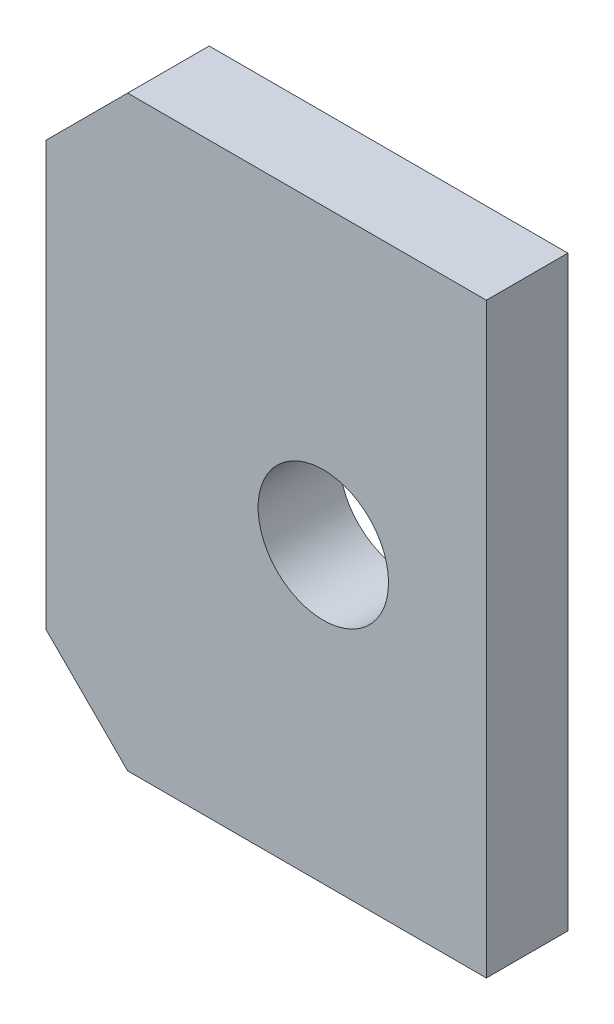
from build123d import *

# Parameters (mm, degrees)
SKICA1_W                           = 27
SKICA1_H                           = 36
VYSUNOUT1_DEPTH                    = 5
M9_0_9_000000_PR_M_ROV_D_RY1_D     = 8
M9_0_9_000000_PR_M_ROV_D_RY1_DEPTH = 15
M9_0_9_000000_PR_M_ROV_D_RY1_TIP   = 2.403442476
ZKOSIT1_SIZE                       = 5


with BuildPart() as part:
    # Skica1 → Vysunout1 (new body)
    with BuildSketch(Plane.XY):
        Rectangle(SKICA1_W, SKICA1_H)
    extrude(amount=VYSUNOUT1_DEPTH)

    # M9.0 _9.000000_ pr_m_rov_ d_ry1
    with Locations(Plane.XY.offset(5)):
        with Locations((3.5, 0)):
            Hole(M9_0_9_000000_PR_M_ROV_D_RY1_D / 2, depth=M9_0_9_000000_PR_M_ROV_D_RY1_DEPTH)
            with Locations((0, 0, -(M9_0_9_000000_PR_M_ROV_D_RY1_DEPTH + M9_0_9_000000_PR_M_ROV_D_RY1_TIP / 2))):  # 118° drill point
                Cone(0, M9_0_9_000000_PR_M_ROV_D_RY1_D / 2, M9_0_9_000000_PR_M_ROV_D_RY1_TIP, mode=Mode.SUBTRACT)

    # Zkosit1
    zkosit1_edges = [part.edges().sort_by_distance(p)[0] for p in [
        (-13.5, 18, 2.5),
        (-13.5, -18, 2.5),
    ]]
    chamfer(zkosit1_edges, length=ZKOSIT1_SIZE)


solid = part.part
